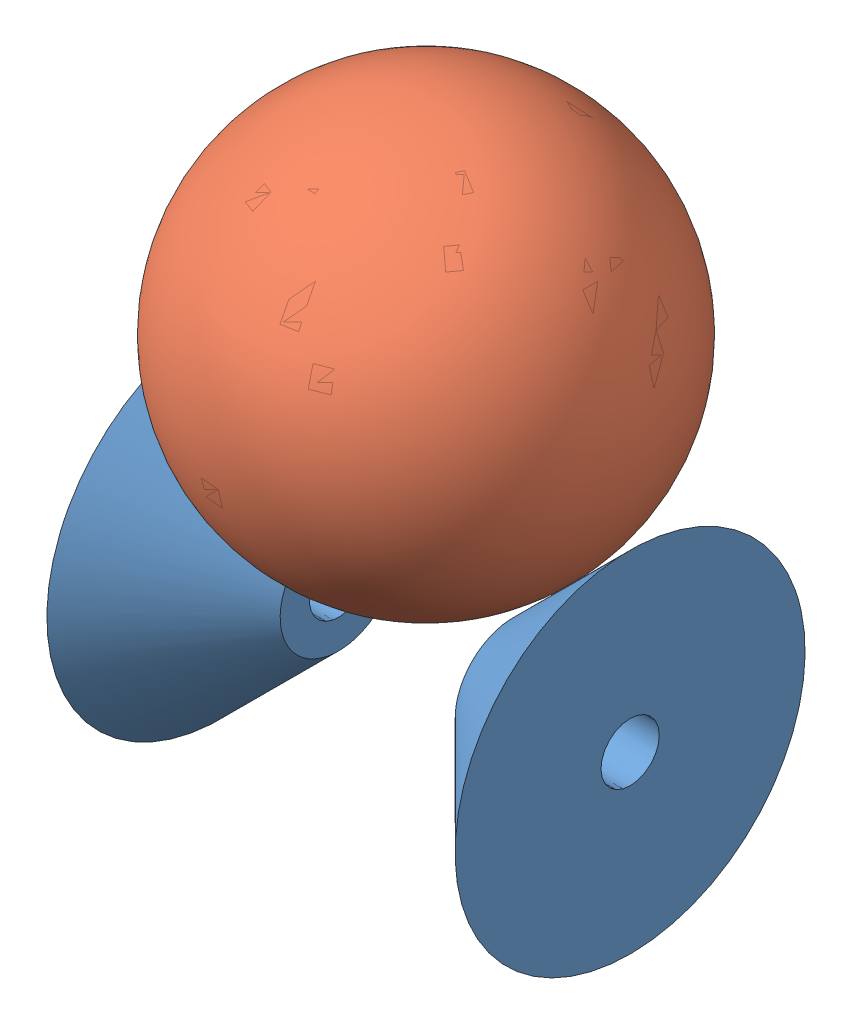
SolidWorks assembly test rotation.SLDASM, configuration Standard (file format 5000). Lengths in mm.
Overall size (98.99 119.49 98.99).
3 component instances, 2 part files, 13 mates.
Components (placement in the parent):
- Kegel-1: Kegel.SLDPRT [Standard] at (-35 0 0) x (0 -0.902642 0.430391) z (0 0.430391 0.902642) size (60 20 60)
- Kegel-2: Kegel.SLDPRT [Standard] at (35 0 0) x (0 -0.962183 -0.272403) z (0 0.272403 -0.962183) size (60 20 60)
- Kugel 70mm-1: Kugel 70mm.SLDPRT [Standard] at (0 44.4975 0) x (-0.71376 0 -0.700391) z (0.700391 0 -0.71376) size (70 70 70)
Mates (geometry in assembly coordinates):
- Deckungsgleich9: coincident: axis of ? through (0 20.2486 -0.0845) axis (0 0.999991 -0.004175)
- Deckungsgleich10: coincident: axis of Kugel 70mm-1 through (0 20.2488 0) axis (0 1 0); plane of assembly
- Deckungsgleich11: coincident: axis of Kegel-1 through (-35 0 0) axis (1 0 0); point of assembly
- Deckungsgleich12: coincident: axis of Kegel-2 through (35 0 0) axis (-1 0 0); point of assembly
- Parallel2: parallel aligned: plane of Kegel-1 through (-15 0 0) normal (1 0 0); plane of assembly through (0 0 0) normal (1 0 0)
- Parallel3: parallel anti-aligned: plane of Kegel-2 through (15 0 0) normal (-1 0 0); plane of assembly through (0 0 0) normal (1 0 0)
- Tangential5: tangent anti-aligned: cone of Kegel-1 through (-15 0 0) axis (1 0 0); sphere of Kugel 70mm-1
- Tangential7: tangent anti-aligned: cone of Kegel-2 through (15 0 0) axis (-1 0 0); sphere of Kugel 70mm-1
- Abstand2: distance = 30 mm anti-aligned: plane of Kegel-1 through (-15 0 0) normal (1 0 0); plane of Kegel-2 through (15 0 0) normal (-1 0 0)
- Zahnradverknüpfung1: gear = 49.4949 mm: circle of Kegel-1; circle of Kugel 70mm-1
- Zahnradverknüpfung2: gear = 37.2674 mm: circle of Kugel 70mm-1; circle of Kegel-2
- Deckungsgleich13: coincident: axis of Kugel 70mm-1 through (0 20.2488 0) axis (0 1 0); point of assembly
- Deckungsgleich14: coincident: axis of Kugel 70mm-1 through (0 20.2488 0) axis (0 1 0); plane of assembly
